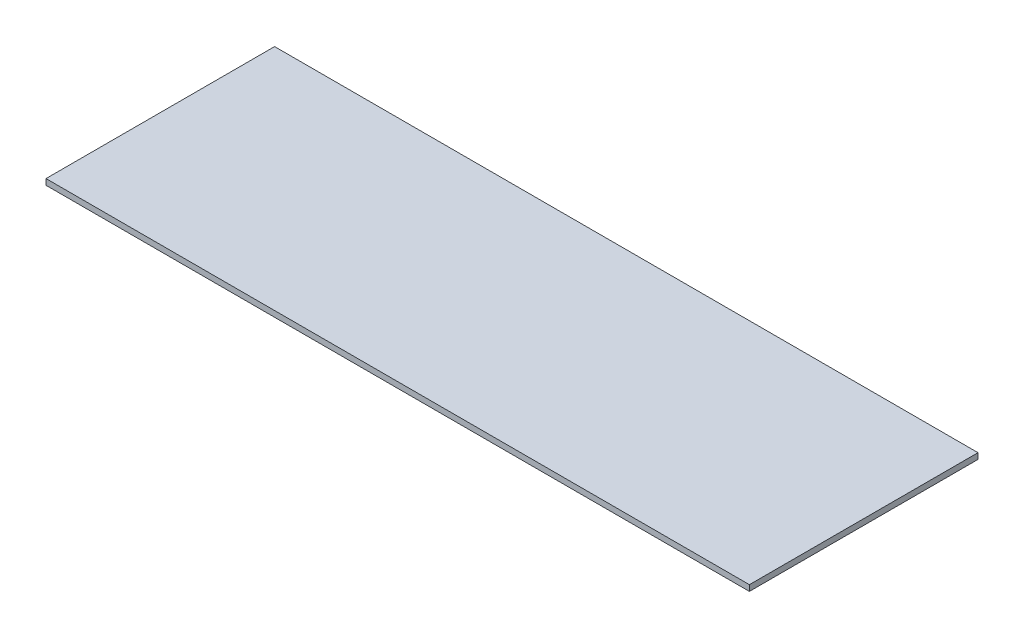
from build123d import *

# Parameters (mm, degrees)
SKETCH1_W           = 762
SKETCH1_H           = 247.65
BOSS_EXTRUDE1_DEPTH = 6.35


with BuildPart() as part:
    # Sketch1 → Boss-Extrude1 (new body)
    with BuildSketch(Plane(origin=(0, 0, 0), x_dir=(1, 0, 0), z_dir=(0, 1, 0))):
        Rectangle(SKETCH1_W, SKETCH1_H)
    extrude(amount=BOSS_EXTRUDE1_DEPTH)


solid = part.part
